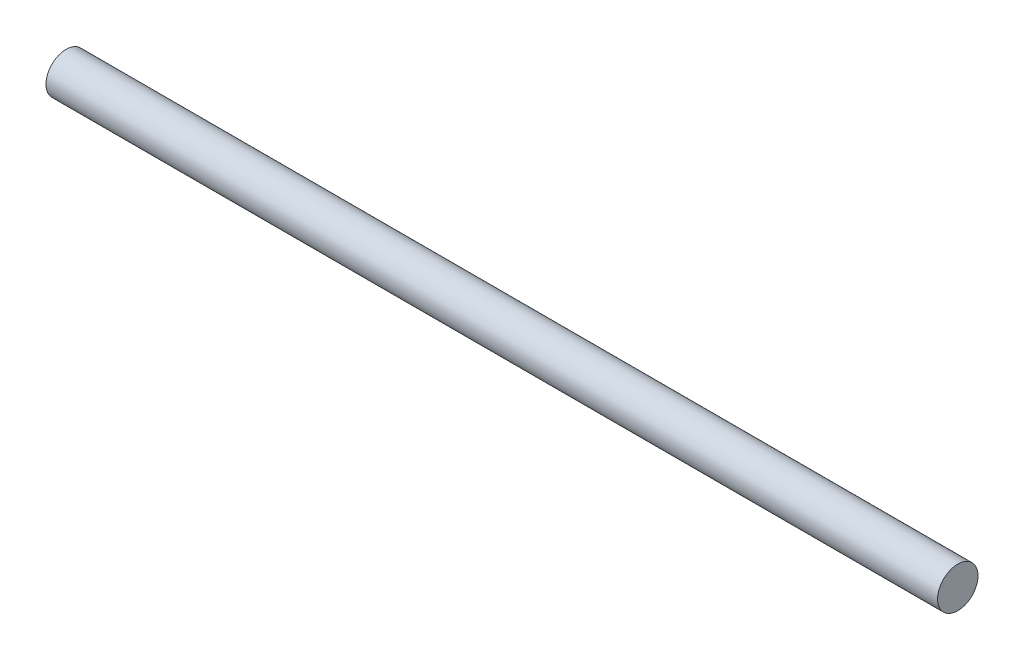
ISO-10303-21;
HEADER;
FILE_DESCRIPTION(('STEP AP214'),'2;1');
FILE_NAME('part.step','',(''),(''),'','','');
FILE_SCHEMA(('AUTOMOTIVE_DESIGN { 1 0 10303 214 1 1 1 1 }'));
ENDSEC;
DATA;
#1=APPLICATION_CONTEXT('core data for automotive mechanical design processes');
#2=APPLICATION_PROTOCOL_DEFINITION('international standard','automotive_design',2000,#1);
#3=PRODUCT_CONTEXT('',#1,'mechanical');
#4=PRODUCT('Part','Part','',(#3));
#5=PRODUCT_RELATED_PRODUCT_CATEGORY('part','',(#4));
#6=PRODUCT_DEFINITION_FORMATION('','',#4);
#7=PRODUCT_DEFINITION_CONTEXT('part definition',#1,'design');
#8=PRODUCT_DEFINITION('design','',#6,#7);
#9=PRODUCT_DEFINITION_SHAPE('','',#8);
#10=(LENGTH_UNIT() NAMED_UNIT(*) SI_UNIT(.MILLI.,.METRE.));
#11=(NAMED_UNIT(*) PLANE_ANGLE_UNIT() SI_UNIT($,.RADIAN.));
#12=(NAMED_UNIT(*) SI_UNIT($,.STERADIAN.) SOLID_ANGLE_UNIT());
#13=UNCERTAINTY_MEASURE_WITH_UNIT(LENGTH_MEASURE(1.E-05),#10,'distance_accuracy_value','');
#14=(GEOMETRIC_REPRESENTATION_CONTEXT(3) GLOBAL_UNCERTAINTY_ASSIGNED_CONTEXT((#13)) GLOBAL_UNIT_ASSIGNED_CONTEXT((#10,
#11,#12)) REPRESENTATION_CONTEXT('',''));
#15=CARTESIAN_POINT('',(0.,0.,0.));
#16=DIRECTION('',(0.,0.,1.));
#17=DIRECTION('',(1.,0.,0.));
#18=AXIS2_PLACEMENT_3D('',#15,#16,#17);
#19=CARTESIAN_POINT('',(140.,0.,0.));
#20=DIRECTION('',(-1.,0.,0.));
#21=DIRECTION('',(0.,0.,1.));
#22=AXIS2_PLACEMENT_3D('',#19,#20,#21);
#23=CYLINDRICAL_SURFACE('',#22,3.175);
#24=CARTESIAN_POINT('',(140.,0.,0.));
#25=DIRECTION('',(1.,0.,0.));
#26=DIRECTION('',(0.,0.,-1.));
#27=AXIS2_PLACEMENT_3D('',#24,#25,#26);
#28=CIRCLE('',#27,3.175);
#29=CARTESIAN_POINT('',(140.,0.,-3.175));
#30=VERTEX_POINT('',#29);
#31=EDGE_CURVE('E10',#30,#30,#28,.T.);
#32=ORIENTED_EDGE('',*,*,#31,.F.);
#33=EDGE_LOOP('',(#32));
#34=FACE_BOUND('',#33,.T.);
#35=CARTESIAN_POINT('',(0.,0.,0.));
#36=DIRECTION('',(1.,0.,0.));
#37=DIRECTION('',(0.,0.,-1.));
#38=AXIS2_PLACEMENT_3D('',#35,#36,#37);
#39=CIRCLE('',#38,3.175);
#40=CARTESIAN_POINT('',(0.,0.,-3.175));
#41=VERTEX_POINT('',#40);
#42=EDGE_CURVE('E36',#41,#41,#39,.T.);
#43=ORIENTED_EDGE('',*,*,#42,.T.);
#44=EDGE_LOOP('',(#43));
#45=FACE_BOUND('',#44,.T.);
#46=ADVANCED_FACE('F33',(#34,#45),#23,.T.);
#47=CARTESIAN_POINT('',(140.,0.,0.));
#48=DIRECTION('',(1.,0.,0.));
#49=DIRECTION('',(0.,0.,-1.));
#50=AXIS2_PLACEMENT_3D('',#47,#48,#49);
#51=PLANE('',#50);
#52=ORIENTED_EDGE('',*,*,#31,.T.);
#53=EDGE_LOOP('',(#52));
#54=FACE_BOUND('',#53,.T.);
#55=ADVANCED_FACE('F48',(#54),#51,.T.);
#56=CARTESIAN_POINT('',(0.,0.,0.));
#57=DIRECTION('',(1.,0.,0.));
#58=DIRECTION('',(0.,0.,-1.));
#59=AXIS2_PLACEMENT_3D('',#56,#57,#58);
#60=PLANE('',#59);
#61=ORIENTED_EDGE('',*,*,#42,.F.);
#62=EDGE_LOOP('',(#61));
#63=FACE_BOUND('',#62,.T.);
#64=ADVANCED_FACE('F46',(#63),#60,.F.);
#65=CLOSED_SHELL('',(#46,#55,#64));
#66=MANIFOLD_SOLID_BREP('B2',#65);
#67=ADVANCED_BREP_SHAPE_REPRESENTATION('',(#18,#66),#14);
#68=SHAPE_DEFINITION_REPRESENTATION(#9,#67);
ENDSEC;
END-ISO-10303-21;
